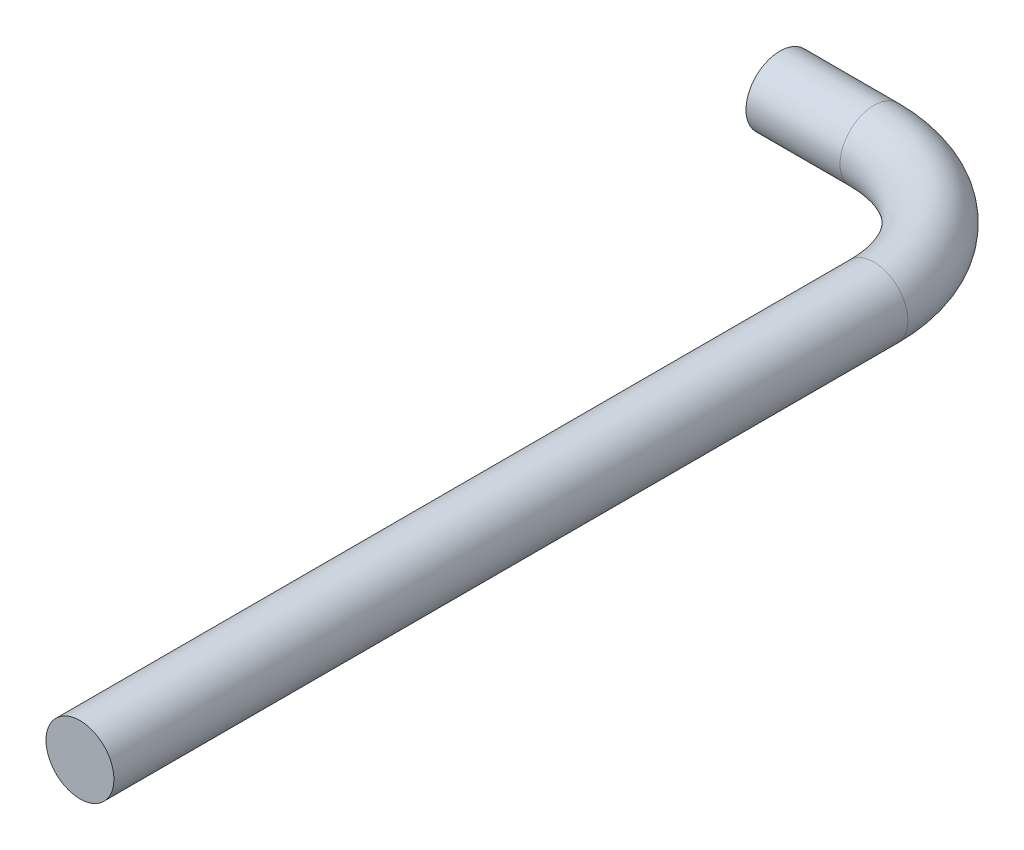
ISO-10303-21;
HEADER;
FILE_DESCRIPTION(('STEP AP214'),'2;1');
FILE_NAME('part.step','',(''),(''),'','','');
FILE_SCHEMA(('AUTOMOTIVE_DESIGN { 1 0 10303 214 1 1 1 1 }'));
ENDSEC;
DATA;
#1=APPLICATION_CONTEXT('core data for automotive mechanical design processes');
#2=APPLICATION_PROTOCOL_DEFINITION('international standard','automotive_design',2000,#1);
#3=PRODUCT_CONTEXT('',#1,'mechanical');
#4=PRODUCT('Part','Part','',(#3));
#5=PRODUCT_RELATED_PRODUCT_CATEGORY('part','',(#4));
#6=PRODUCT_DEFINITION_FORMATION('','',#4);
#7=PRODUCT_DEFINITION_CONTEXT('part definition',#1,'design');
#8=PRODUCT_DEFINITION('design','',#6,#7);
#9=PRODUCT_DEFINITION_SHAPE('','',#8);
#10=(LENGTH_UNIT() NAMED_UNIT(*) SI_UNIT(.MILLI.,.METRE.));
#11=(NAMED_UNIT(*) PLANE_ANGLE_UNIT() SI_UNIT($,.RADIAN.));
#12=(NAMED_UNIT(*) SI_UNIT($,.STERADIAN.) SOLID_ANGLE_UNIT());
#13=UNCERTAINTY_MEASURE_WITH_UNIT(LENGTH_MEASURE(1.E-05),#10,'distance_accuracy_value','');
#14=(GEOMETRIC_REPRESENTATION_CONTEXT(3) GLOBAL_UNCERTAINTY_ASSIGNED_CONTEXT((#13)) GLOBAL_UNIT_ASSIGNED_CONTEXT((#10,
#11,#12)) REPRESENTATION_CONTEXT('',''));
#15=CARTESIAN_POINT('',(0.,0.,0.));
#16=DIRECTION('',(0.,0.,1.));
#17=DIRECTION('',(1.,0.,0.));
#18=AXIS2_PLACEMENT_3D('',#15,#16,#17);
#19=CARTESIAN_POINT('',(0.,0.,130.));
#20=DIRECTION('',(0.,0.,1.));
#21=DIRECTION('',(1.,0.,0.));
#22=AXIS2_PLACEMENT_3D('',#19,#20,#21);
#23=CYLINDRICAL_SURFACE('',#22,32.5);
#24=CARTESIAN_POINT('',(0.,0.,130.));
#25=DIRECTION('',(0.,0.,-1.));
#26=DIRECTION('',(-1.,0.,0.));
#27=AXIS2_PLACEMENT_3D('',#24,#25,#26);
#28=CIRCLE('',#27,32.5);
#29=CARTESIAN_POINT('',(32.5,0.,130.));
#30=VERTEX_POINT('',#29);
#31=EDGE_CURVE('E18',#30,#30,#28,.T.);
#32=ORIENTED_EDGE('',*,*,#31,.F.);
#33=EDGE_LOOP('',(#32));
#34=FACE_BOUND('',#33,.T.);
#35=CARTESIAN_POINT('',(1.09183820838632E-13,0.,890.));
#36=DIRECTION('',(0.,0.,-1.));
#37=DIRECTION('',(-1.,0.,0.));
#38=AXIS2_PLACEMENT_3D('',#35,#36,#37);
#39=CIRCLE('',#38,32.5);
#40=CARTESIAN_POINT('',(-32.4999999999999,0.,890.));
#41=VERTEX_POINT('',#40);
#42=EDGE_CURVE('E8',#41,#41,#39,.T.);
#43=ORIENTED_EDGE('',*,*,#42,.T.);
#44=EDGE_LOOP('',(#43));
#45=FACE_BOUND('',#44,.T.);
#46=ADVANCED_FACE('F12',(#34,#45),#23,.T.);
#47=CARTESIAN_POINT('',(-130.,0.,130.));
#48=DIRECTION('',(0.,-1.,0.));
#49=DIRECTION('',(0.,0.,-1.));
#50=AXIS2_PLACEMENT_3D('',#47,#48,#49);
#51=TOROIDAL_SURFACE('',#50,130.,32.5);
#52=CARTESIAN_POINT('',(-130.,0.,0.));
#53=DIRECTION('',(-1.,0.,0.));
#54=DIRECTION('',(0.,0.,1.));
#55=AXIS2_PLACEMENT_3D('',#52,#53,#54);
#56=CIRCLE('',#55,32.5);
#57=CARTESIAN_POINT('',(-130.,0.,-32.5));
#58=VERTEX_POINT('',#57);
#59=EDGE_CURVE('E22',#58,#58,#56,.T.);
#60=CARTESIAN_POINT('',(-130.,0.,130.));
#61=DIRECTION('',(0.,-1.,0.));
#62=DIRECTION('',(0.,0.,-1.));
#63=AXIS2_PLACEMENT_3D('',#60,#61,#62);
#64=CIRCLE('',#63,162.5);
#65=EDGE_CURVE('',#58,#30,#64,.T.);
#66=ORIENTED_EDGE('',*,*,#59,.F.);
#67=ORIENTED_EDGE('',*,*,#31,.T.);
#68=ORIENTED_EDGE('',*,*,#65,.T.);
#69=ORIENTED_EDGE('',*,*,#65,.F.);
#70=EDGE_LOOP('',(#66,#68,#67,#69));
#71=FACE_BOUND('',#70,.T.);
#72=ADVANCED_FACE('F37',(#71),#51,.T.);
#73=CARTESIAN_POINT('',(-130.,0.,0.));
#74=DIRECTION('',(-1.,0.,0.));
#75=DIRECTION('',(0.,0.,1.));
#76=AXIS2_PLACEMENT_3D('',#73,#74,#75);
#77=CYLINDRICAL_SURFACE('',#76,32.5);
#78=ORIENTED_EDGE('',*,*,#59,.T.);
#79=EDGE_LOOP('',(#78));
#80=FACE_BOUND('',#79,.T.);
#81=CARTESIAN_POINT('',(-220.,0.,0.));
#82=DIRECTION('',(-1.,0.,0.));
#83=DIRECTION('',(0.,0.,1.));
#84=AXIS2_PLACEMENT_3D('',#81,#82,#83);
#85=CIRCLE('',#84,32.5);
#86=CARTESIAN_POINT('',(-220.,0.,32.5));
#87=VERTEX_POINT('',#86);
#88=EDGE_CURVE('E26',#87,#87,#85,.T.);
#89=ORIENTED_EDGE('',*,*,#88,.F.);
#90=EDGE_LOOP('',(#89));
#91=FACE_BOUND('',#90,.T.);
#92=ADVANCED_FACE('F34',(#80,#91),#77,.T.);
#93=CARTESIAN_POINT('',(1.09183820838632E-13,0.,890.));
#94=DIRECTION('',(0.,0.,-1.));
#95=DIRECTION('',(-1.,0.,0.));
#96=AXIS2_PLACEMENT_3D('',#93,#94,#95);
#97=PLANE('',#96);
#98=ORIENTED_EDGE('',*,*,#42,.F.);
#99=EDGE_LOOP('',(#98));
#100=FACE_BOUND('',#99,.T.);
#101=ADVANCED_FACE('F36',(#100),#97,.F.);
#102=CARTESIAN_POINT('',(-220.,0.,0.));
#103=DIRECTION('',(-1.,0.,0.));
#104=DIRECTION('',(0.,0.,1.));
#105=AXIS2_PLACEMENT_3D('',#102,#103,#104);
#106=PLANE('',#105);
#107=ORIENTED_EDGE('',*,*,#88,.T.);
#108=EDGE_LOOP('',(#107));
#109=FACE_BOUND('',#108,.T.);
#110=ADVANCED_FACE('F32',(#109),#106,.T.);
#111=CLOSED_SHELL('',(#46,#72,#92,#101,#110));
#112=MANIFOLD_SOLID_BREP('B1',#111);
#113=ADVANCED_BREP_SHAPE_REPRESENTATION('',(#18,#112),#14);
#114=SHAPE_DEFINITION_REPRESENTATION(#9,#113);
ENDSEC;
END-ISO-10303-21;
